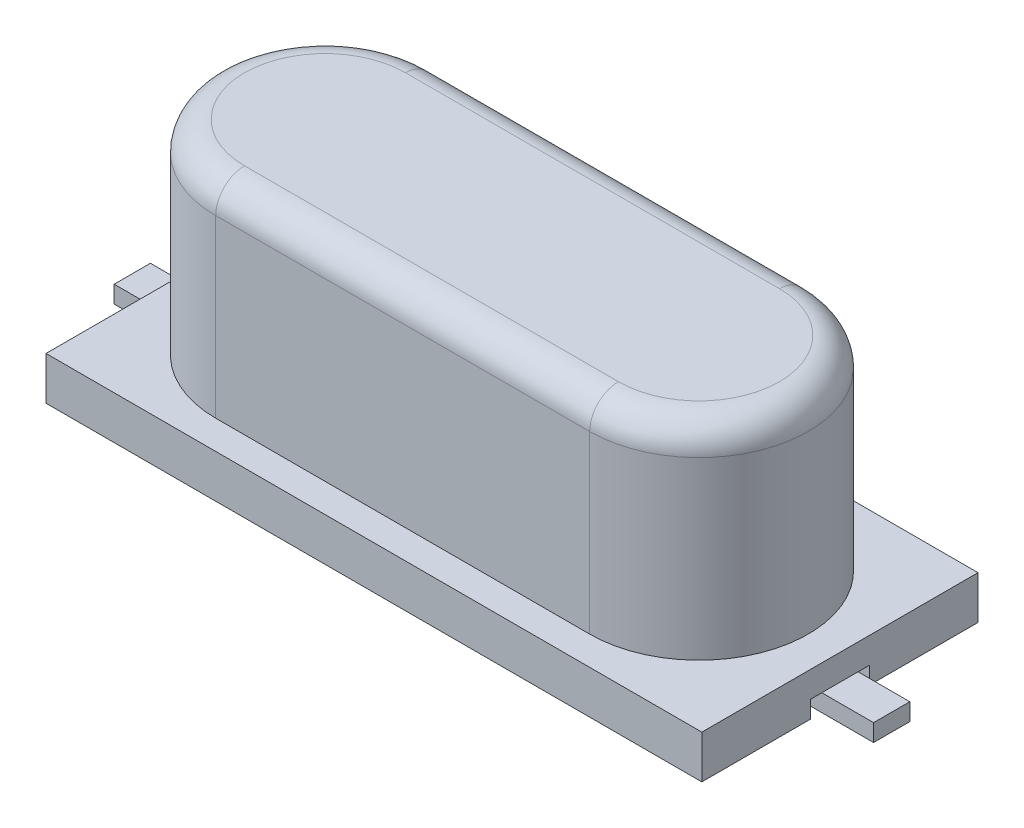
ISO-10303-21;
HEADER;
FILE_DESCRIPTION(('STEP AP214'),'2;1');
FILE_NAME('part.step','',(''),(''),'','','');
FILE_SCHEMA(('AUTOMOTIVE_DESIGN { 1 0 10303 214 1 1 1 1 }'));
ENDSEC;
DATA;
#1=APPLICATION_CONTEXT('core data for automotive mechanical design processes');
#2=APPLICATION_PROTOCOL_DEFINITION('international standard','automotive_design',2000,#1);
#3=PRODUCT_CONTEXT('',#1,'mechanical');
#4=PRODUCT('Part','Part','',(#3));
#5=PRODUCT_RELATED_PRODUCT_CATEGORY('part','',(#4));
#6=PRODUCT_DEFINITION_FORMATION('','',#4);
#7=PRODUCT_DEFINITION_CONTEXT('part definition',#1,'design');
#8=PRODUCT_DEFINITION('design','',#6,#7);
#9=PRODUCT_DEFINITION_SHAPE('','',#8);
#10=(LENGTH_UNIT() NAMED_UNIT(*) SI_UNIT(.MILLI.,.METRE.));
#11=(NAMED_UNIT(*) PLANE_ANGLE_UNIT() SI_UNIT($,.RADIAN.));
#12=(NAMED_UNIT(*) SI_UNIT($,.STERADIAN.) SOLID_ANGLE_UNIT());
#13=UNCERTAINTY_MEASURE_WITH_UNIT(LENGTH_MEASURE(1.E-05),#10,'distance_accuracy_value','');
#14=(GEOMETRIC_REPRESENTATION_CONTEXT(3) GLOBAL_UNCERTAINTY_ASSIGNED_CONTEXT((#13)) GLOBAL_UNIT_ASSIGNED_CONTEXT((#10,
#11,#12)) REPRESENTATION_CONTEXT('',''));
#15=CARTESIAN_POINT('',(0.,0.,0.));
#16=DIRECTION('',(0.,0.,1.));
#17=DIRECTION('',(1.,0.,0.));
#18=AXIS2_PLACEMENT_3D('',#15,#16,#17);
#19=CARTESIAN_POINT('',(-5.7,0.75,-2.4));
#20=DIRECTION('',(0.,-1.,0.));
#21=DIRECTION('',(0.,0.,-1.));
#22=AXIS2_PLACEMENT_3D('',#19,#20,#21);
#23=PLANE('',#22);
#24=DIRECTION('',(0.,0.,1.));
#25=VECTOR('',#24,1.);
#26=CARTESIAN_POINT('',(-5.7,0.75,2.4));
#27=LINE('',#26,#25);
#28=CARTESIAN_POINT('',(-5.7,0.75,-2.4));
#29=VERTEX_POINT('',#28);
#30=CARTESIAN_POINT('',(-5.7,0.75,2.4));
#31=VERTEX_POINT('',#30);
#32=EDGE_CURVE('E405',#29,#31,#27,.T.);
#33=ORIENTED_EDGE('',*,*,#32,.T.);
#34=DIRECTION('',(1.,0.,0.));
#35=VECTOR('',#34,1.);
#36=CARTESIAN_POINT('',(-5.7,0.75,2.4));
#37=LINE('',#36,#35);
#38=CARTESIAN_POINT('',(5.7,0.75,2.4));
#39=VERTEX_POINT('',#38);
#40=EDGE_CURVE('E409',#31,#39,#37,.T.);
#41=ORIENTED_EDGE('',*,*,#40,.T.);
#42=DIRECTION('',(0.,0.,-1.));
#43=VECTOR('',#42,1.);
#44=CARTESIAN_POINT('',(5.7,0.75,2.4));
#45=LINE('',#44,#43);
#46=CARTESIAN_POINT('',(5.7,0.75,-2.4));
#47=VERTEX_POINT('',#46);
#48=EDGE_CURVE('E413',#39,#47,#45,.T.);
#49=ORIENTED_EDGE('',*,*,#48,.T.);
#50=DIRECTION('',(-1.,0.,0.));
#51=VECTOR('',#50,1.);
#52=CARTESIAN_POINT('',(-5.7,0.75,-2.4));
#53=LINE('',#52,#51);
#54=EDGE_CURVE('E416',#47,#29,#53,.T.);
#55=ORIENTED_EDGE('',*,*,#54,.T.);
#56=EDGE_LOOP('',(#33,#41,#49,#55));
#57=FACE_BOUND('',#56,.T.);
#58=CARTESIAN_POINT('',(-3.25,0.75,0.));
#59=DIRECTION('',(0.,1.,0.));
#60=DIRECTION('',(0.,0.,1.));
#61=AXIS2_PLACEMENT_3D('',#58,#59,#60);
#62=CIRCLE('',#61,1.9);
#63=CARTESIAN_POINT('',(-3.25,0.75,-1.9));
#64=VERTEX_POINT('',#63);
#65=CARTESIAN_POINT('',(-3.25,0.75,1.9));
#66=VERTEX_POINT('',#65);
#67=EDGE_CURVE('E226',#64,#66,#62,.T.);
#68=ORIENTED_EDGE('',*,*,#67,.F.);
#69=DIRECTION('',(-1.,0.,0.));
#70=VECTOR('',#69,1.);
#71=CARTESIAN_POINT('',(-3.25,0.75,-1.9));
#72=LINE('',#71,#70);
#73=CARTESIAN_POINT('',(3.25,0.75,-1.9));
#74=VERTEX_POINT('',#73);
#75=EDGE_CURVE('E234',#74,#64,#72,.T.);
#76=ORIENTED_EDGE('',*,*,#75,.F.);
#77=CARTESIAN_POINT('',(3.25,0.75,0.));
#78=DIRECTION('',(0.,1.,0.));
#79=DIRECTION('',(0.,0.,1.));
#80=AXIS2_PLACEMENT_3D('',#77,#78,#79);
#81=CIRCLE('',#80,1.9);
#82=CARTESIAN_POINT('',(3.25,0.75,1.9));
#83=VERTEX_POINT('',#82);
#84=EDGE_CURVE('E247',#83,#74,#81,.T.);
#85=ORIENTED_EDGE('',*,*,#84,.F.);
#86=DIRECTION('',(1.,0.,0.));
#87=VECTOR('',#86,1.);
#88=CARTESIAN_POINT('',(-3.25,0.75,1.9));
#89=LINE('',#88,#87);
#90=EDGE_CURVE('E242',#66,#83,#89,.T.);
#91=ORIENTED_EDGE('',*,*,#90,.F.);
#92=EDGE_LOOP('',(#68,#76,#85,#91));
#93=FACE_BOUND('',#92,.T.);
#94=ADVANCED_FACE('F36',(#57,#93),#23,.F.);
#95=CARTESIAN_POINT('',(-5.7,0.3,-2.4));
#96=DIRECTION('',(0.,-1.,0.));
#97=DIRECTION('',(0.,0.,-1.));
#98=AXIS2_PLACEMENT_3D('',#95,#96,#97);
#99=PLANE('',#98);
#100=DIRECTION('',(0.,0.,1.));
#101=VECTOR('',#100,1.);
#102=CARTESIAN_POINT('',(-5.7,0.3,2.4));
#103=LINE('',#102,#101);
#104=CARTESIAN_POINT('',(-5.7,0.3,-0.515));
#105=VERTEX_POINT('',#104);
#106=CARTESIAN_POINT('',(-5.7,0.3,-0.315));
#107=VERTEX_POINT('',#106);
#108=EDGE_CURVE('E420',#105,#107,#103,.T.);
#109=ORIENTED_EDGE('',*,*,#108,.F.);
#110=DIRECTION('',(1.,0.,0.));
#111=VECTOR('',#110,1.);
#112=CARTESIAN_POINT('',(-2.,0.3,-0.515000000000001));
#113=LINE('',#112,#111);
#114=CARTESIAN_POINT('',(-2.,0.3,-0.515000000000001));
#115=VERTEX_POINT('',#114);
#116=EDGE_CURVE('E268',#105,#115,#113,.T.);
#117=ORIENTED_EDGE('',*,*,#116,.T.);
#118=DIRECTION('',(0.,0.,1.));
#119=VECTOR('',#118,1.);
#120=CARTESIAN_POINT('',(-2.,0.3,0.515000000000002));
#121=LINE('',#120,#119);
#122=CARTESIAN_POINT('',(-2.,0.3,0.515000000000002));
#123=VERTEX_POINT('',#122);
#124=EDGE_CURVE('E273',#115,#123,#121,.T.);
#125=ORIENTED_EDGE('',*,*,#124,.T.);
#126=DIRECTION('',(-1.,0.,0.));
#127=VECTOR('',#126,1.);
#128=CARTESIAN_POINT('',(-5.7,0.3,0.515000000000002));
#129=LINE('',#128,#127);
#130=CARTESIAN_POINT('',(-5.7,0.3,0.515000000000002));
#131=VERTEX_POINT('',#130);
#132=EDGE_CURVE('E277',#123,#131,#129,.T.);
#133=ORIENTED_EDGE('',*,*,#132,.T.);
#134=CARTESIAN_POINT('',(-5.7,0.3,0.315000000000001));
#135=VERTEX_POINT('',#134);
#136=EDGE_CURVE('E404',#135,#131,#103,.T.);
#137=ORIENTED_EDGE('',*,*,#136,.F.);
#138=DIRECTION('',(1.,0.,0.));
#139=VECTOR('',#138,1.);
#140=CARTESIAN_POINT('',(-6.6,0.3,0.315));
#141=LINE('',#140,#139);
#142=CARTESIAN_POINT('',(-2.2,0.3,0.315000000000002));
#143=VERTEX_POINT('',#142);
#144=EDGE_CURVE('E443',#135,#143,#141,.T.);
#145=ORIENTED_EDGE('',*,*,#144,.T.);
#146=DIRECTION('',(0.,0.,-1.));
#147=VECTOR('',#146,1.);
#148=CARTESIAN_POINT('',(-2.2,0.3,0.315000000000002));
#149=LINE('',#148,#147);
#150=CARTESIAN_POINT('',(-2.2,0.3,-0.315000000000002));
#151=VERTEX_POINT('',#150);
#152=EDGE_CURVE('E448',#143,#151,#149,.T.);
#153=ORIENTED_EDGE('',*,*,#152,.T.);
#154=DIRECTION('',(-1.,0.,0.));
#155=VECTOR('',#154,1.);
#156=CARTESIAN_POINT('',(-6.6,0.3,-0.315));
#157=LINE('',#156,#155);
#158=EDGE_CURVE('E453',#151,#107,#157,.T.);
#159=ORIENTED_EDGE('',*,*,#158,.T.);
#160=EDGE_LOOP('',(#109,#117,#125,#133,#137,#145,#153,#159));
#161=FACE_BOUND('',#160,.T.);
#162=ADVANCED_FACE('F599',(#161),#99,.T.);
#163=DIRECTION('',(0.,0.,-1.));
#164=VECTOR('',#163,1.);
#165=CARTESIAN_POINT('',(2.,0.3,-0.515000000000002));
#166=LINE('',#165,#164);
#167=CARTESIAN_POINT('',(2.,0.3,0.515000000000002));
#168=VERTEX_POINT('',#167);
#169=CARTESIAN_POINT('',(2.,0.3,-0.515000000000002));
#170=VERTEX_POINT('',#169);
#171=EDGE_CURVE('E285',#168,#170,#166,.T.);
#172=ORIENTED_EDGE('',*,*,#171,.T.);
#173=DIRECTION('',(1.,0.,0.));
#174=VECTOR('',#173,1.);
#175=CARTESIAN_POINT('',(5.7,0.3,-0.515000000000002));
#176=LINE('',#175,#174);
#177=CARTESIAN_POINT('',(5.7,0.3,-0.515000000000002));
#178=VERTEX_POINT('',#177);
#179=EDGE_CURVE('E264',#170,#178,#176,.T.);
#180=ORIENTED_EDGE('',*,*,#179,.T.);
#181=DIRECTION('',(0.,0.,-1.));
#182=VECTOR('',#181,1.);
#183=CARTESIAN_POINT('',(5.7,0.3,2.4));
#184=LINE('',#183,#182);
#185=CARTESIAN_POINT('',(5.7,0.3,-0.315));
#186=VERTEX_POINT('',#185);
#187=EDGE_CURVE('E423',#186,#178,#184,.T.);
#188=ORIENTED_EDGE('',*,*,#187,.F.);
#189=DIRECTION('',(-1.,0.,0.));
#190=VECTOR('',#189,1.);
#191=CARTESIAN_POINT('',(-5.7,0.3,-0.315000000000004));
#192=LINE('',#191,#190);
#193=CARTESIAN_POINT('',(2.2,0.3,-0.315000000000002));
#194=VERTEX_POINT('',#193);
#195=EDGE_CURVE('E484',#186,#194,#192,.T.);
#196=ORIENTED_EDGE('',*,*,#195,.T.);
#197=DIRECTION('',(0.,0.,1.));
#198=VECTOR('',#197,1.);
#199=CARTESIAN_POINT('',(2.2,0.3,0.315000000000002));
#200=LINE('',#199,#198);
#201=CARTESIAN_POINT('',(2.2,0.3,0.315000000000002));
#202=VERTEX_POINT('',#201);
#203=EDGE_CURVE('E373',#194,#202,#200,.T.);
#204=ORIENTED_EDGE('',*,*,#203,.T.);
#205=DIRECTION('',(1.,0.,0.));
#206=VECTOR('',#205,1.);
#207=CARTESIAN_POINT('',(6.6,0.3,0.315));
#208=LINE('',#207,#206);
#209=CARTESIAN_POINT('',(5.7,0.3,0.315));
#210=VERTEX_POINT('',#209);
#211=EDGE_CURVE('E361',#202,#210,#208,.T.);
#212=ORIENTED_EDGE('',*,*,#211,.T.);
#213=CARTESIAN_POINT('',(5.7,0.3,0.515000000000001));
#214=VERTEX_POINT('',#213);
#215=EDGE_CURVE('E410',#214,#210,#184,.T.);
#216=ORIENTED_EDGE('',*,*,#215,.F.);
#217=DIRECTION('',(-1.,0.,0.));
#218=VECTOR('',#217,1.);
#219=CARTESIAN_POINT('',(2.,0.3,0.515000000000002));
#220=LINE('',#219,#218);
#221=EDGE_CURVE('E281',#214,#168,#220,.T.);
#222=ORIENTED_EDGE('',*,*,#221,.T.);
#223=EDGE_LOOP('',(#172,#180,#188,#196,#204,#212,#216,#222));
#224=FACE_BOUND('',#223,.T.);
#225=ADVANCED_FACE('F546',(#224),#99,.T.);
#226=CARTESIAN_POINT('',(-6.6,0.3,-0.315));
#227=DIRECTION('',(0.,-1.,0.));
#228=DIRECTION('',(0.,0.,-1.));
#229=AXIS2_PLACEMENT_3D('',#226,#227,#228);
#230=PLANE('',#229);
#231=EDGE_CURVE('E424',#107,#135,#103,.T.);
#232=ORIENTED_EDGE('',*,*,#231,.F.);
#233=CARTESIAN_POINT('',(-6.6,0.3,-0.315));
#234=VERTEX_POINT('',#233);
#235=EDGE_CURVE('E452',#107,#234,#157,.T.);
#236=ORIENTED_EDGE('',*,*,#235,.T.);
#237=DIRECTION('',(0.,0.,1.));
#238=VECTOR('',#237,1.);
#239=CARTESIAN_POINT('',(-6.6,0.3,0.315));
#240=LINE('',#239,#238);
#241=CARTESIAN_POINT('',(-6.6,0.3,0.315));
#242=VERTEX_POINT('',#241);
#243=EDGE_CURVE('E439',#234,#242,#240,.T.);
#244=ORIENTED_EDGE('',*,*,#243,.T.);
#245=EDGE_CURVE('E445',#242,#135,#141,.T.);
#246=ORIENTED_EDGE('',*,*,#245,.T.);
#247=EDGE_LOOP('',(#232,#236,#244,#246));
#248=FACE_BOUND('',#247,.T.);
#249=ADVANCED_FACE('F616',(#248),#230,.F.);
#250=CARTESIAN_POINT('',(-6.6,0.3,0.315));
#251=DIRECTION('',(1.,0.,0.));
#252=DIRECTION('',(0.,0.,-1.));
#253=AXIS2_PLACEMENT_3D('',#250,#251,#252);
#254=PLANE('',#253);
#255=DIRECTION('',(0.,0.,1.));
#256=VECTOR('',#255,1.);
#257=CARTESIAN_POINT('',(-6.6,0.,0.315));
#258=LINE('',#257,#256);
#259=CARTESIAN_POINT('',(-6.6,0.,-0.315));
#260=VERTEX_POINT('',#259);
#261=CARTESIAN_POINT('',(-6.6,0.,0.315));
#262=VERTEX_POINT('',#261);
#263=EDGE_CURVE('E438',#260,#262,#258,.T.);
#264=ORIENTED_EDGE('',*,*,#263,.T.);
#265=DIRECTION('',(0.,-1.,0.));
#266=VECTOR('',#265,1.);
#267=CARTESIAN_POINT('',(-6.6,0.3,0.315));
#268=LINE('',#267,#266);
#269=EDGE_CURVE('E480',#242,#262,#268,.T.);
#270=ORIENTED_EDGE('',*,*,#269,.F.);
#271=ORIENTED_EDGE('',*,*,#243,.F.);
#272=DIRECTION('',(0.,-1.,0.));
#273=VECTOR('',#272,1.);
#274=CARTESIAN_POINT('',(-6.6,0.3,-0.315));
#275=LINE('',#274,#273);
#276=EDGE_CURVE('E457',#234,#260,#275,.T.);
#277=ORIENTED_EDGE('',*,*,#276,.T.);
#278=EDGE_LOOP('',(#264,#270,#271,#277));
#279=FACE_BOUND('',#278,.T.);
#280=ADVANCED_FACE('F625',(#279),#254,.F.);
#281=CARTESIAN_POINT('',(-6.6,0.3,0.315));
#282=DIRECTION('',(0.,0.,-1.));
#283=DIRECTION('',(-1.,0.,0.));
#284=AXIS2_PLACEMENT_3D('',#281,#282,#283);
#285=PLANE('',#284);
#286=DIRECTION('',(1.,0.,0.));
#287=VECTOR('',#286,1.);
#288=CARTESIAN_POINT('',(-6.6,0.,0.315));
#289=LINE('',#288,#287);
#290=CARTESIAN_POINT('',(-2.2,0.,0.315000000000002));
#291=VERTEX_POINT('',#290);
#292=EDGE_CURVE('E461',#262,#291,#289,.T.);
#293=ORIENTED_EDGE('',*,*,#292,.T.);
#294=DIRECTION('',(0.,-1.,0.));
#295=VECTOR('',#294,1.);
#296=CARTESIAN_POINT('',(-2.2,0.3,0.315000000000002));
#297=LINE('',#296,#295);
#298=EDGE_CURVE('E476',#143,#291,#297,.T.);
#299=ORIENTED_EDGE('',*,*,#298,.F.);
#300=ORIENTED_EDGE('',*,*,#144,.F.);
#301=ORIENTED_EDGE('',*,*,#245,.F.);
#302=ORIENTED_EDGE('',*,*,#269,.T.);
#303=EDGE_LOOP('',(#293,#299,#300,#301,#302));
#304=FACE_BOUND('',#303,.T.);
#305=ADVANCED_FACE('F627',(#304),#285,.F.);
#306=CARTESIAN_POINT('',(-2.2,0.3,0.315000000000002));
#307=DIRECTION('',(-1.,0.,0.));
#308=DIRECTION('',(0.,0.,1.));
#309=AXIS2_PLACEMENT_3D('',#306,#307,#308);
#310=PLANE('',#309);
#311=DIRECTION('',(0.,0.,-1.));
#312=VECTOR('',#311,1.);
#313=CARTESIAN_POINT('',(-2.2,0.,0.315000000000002));
#314=LINE('',#313,#312);
#315=CARTESIAN_POINT('',(-2.2,0.,-0.315000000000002));
#316=VERTEX_POINT('',#315);
#317=EDGE_CURVE('E464',#291,#316,#314,.T.);
#318=ORIENTED_EDGE('',*,*,#317,.T.);
#319=DIRECTION('',(0.,-1.,0.));
#320=VECTOR('',#319,1.);
#321=CARTESIAN_POINT('',(-2.2,0.3,-0.315000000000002));
#322=LINE('',#321,#320);
#323=EDGE_CURVE('E472',#151,#316,#322,.T.);
#324=ORIENTED_EDGE('',*,*,#323,.F.);
#325=ORIENTED_EDGE('',*,*,#152,.F.);
#326=ORIENTED_EDGE('',*,*,#298,.T.);
#327=EDGE_LOOP('',(#318,#324,#325,#326));
#328=FACE_BOUND('',#327,.T.);
#329=ADVANCED_FACE('F631',(#328),#310,.F.);
#330=CARTESIAN_POINT('',(-6.6,0.3,-0.315));
#331=DIRECTION('',(0.,0.,1.));
#332=DIRECTION('',(1.,0.,0.));
#333=AXIS2_PLACEMENT_3D('',#330,#331,#332);
#334=PLANE('',#333);
#335=DIRECTION('',(-1.,0.,0.));
#336=VECTOR('',#335,1.);
#337=CARTESIAN_POINT('',(-6.6,0.,-0.315));
#338=LINE('',#337,#336);
#339=EDGE_CURVE('E444',#316,#260,#338,.T.);
#340=ORIENTED_EDGE('',*,*,#339,.T.);
#341=ORIENTED_EDGE('',*,*,#276,.F.);
#342=ORIENTED_EDGE('',*,*,#235,.F.);
#343=ORIENTED_EDGE('',*,*,#158,.F.);
#344=ORIENTED_EDGE('',*,*,#323,.T.);
#345=EDGE_LOOP('',(#340,#341,#342,#343,#344));
#346=FACE_BOUND('',#345,.T.);
#347=ADVANCED_FACE('F619',(#346),#334,.F.);
#348=CARTESIAN_POINT('',(-6.6,0.,-0.315));
#349=DIRECTION('',(0.,-1.,0.));
#350=DIRECTION('',(0.,0.,-1.));
#351=AXIS2_PLACEMENT_3D('',#348,#349,#350);
#352=PLANE('',#351);
#353=ORIENTED_EDGE('',*,*,#263,.F.);
#354=ORIENTED_EDGE('',*,*,#339,.F.);
#355=ORIENTED_EDGE('',*,*,#317,.F.);
#356=ORIENTED_EDGE('',*,*,#292,.F.);
#357=EDGE_LOOP('',(#353,#354,#355,#356));
#358=FACE_BOUND('',#357,.T.);
#359=ADVANCED_FACE('F633',(#358),#352,.T.);
#360=CARTESIAN_POINT('',(-5.7,0.75,2.4));
#361=DIRECTION('',(1.,0.,0.));
#362=DIRECTION('',(0.,0.,-1.));
#363=AXIS2_PLACEMENT_3D('',#360,#361,#362);
#364=PLANE('',#363);
#365=DIRECTION('',(0.,-1.,0.));
#366=VECTOR('',#365,1.);
#367=CARTESIAN_POINT('',(-5.7,0.75,-2.4));
#368=LINE('',#367,#366);
#369=CARTESIAN_POINT('',(-5.7,0.,-2.4));
#370=VERTEX_POINT('',#369);
#371=EDGE_CURVE('E419',#29,#370,#368,.T.);
#372=ORIENTED_EDGE('',*,*,#371,.T.);
#373=DIRECTION('',(0.,0.,1.));
#374=VECTOR('',#373,1.);
#375=CARTESIAN_POINT('',(-5.7,0.,-0.515));
#376=LINE('',#375,#374);
#377=CARTESIAN_POINT('',(-5.7,0.,-0.515));
#378=VERTEX_POINT('',#377);
#379=EDGE_CURVE('E301',#370,#378,#376,.T.);
#380=ORIENTED_EDGE('',*,*,#379,.T.);
#381=DIRECTION('',(0.,-1.,0.));
#382=VECTOR('',#381,1.);
#383=CARTESIAN_POINT('',(-5.7,0.3,-0.515));
#384=LINE('',#383,#382);
#385=EDGE_CURVE('E352',#105,#378,#384,.T.);
#386=ORIENTED_EDGE('',*,*,#385,.F.);
#387=ORIENTED_EDGE('',*,*,#108,.T.);
#388=ORIENTED_EDGE('',*,*,#231,.T.);
#389=ORIENTED_EDGE('',*,*,#136,.T.);
#390=DIRECTION('',(0.,-1.,0.));
#391=VECTOR('',#390,1.);
#392=CARTESIAN_POINT('',(-5.7,0.3,0.515000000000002));
#393=LINE('',#392,#391);
#394=CARTESIAN_POINT('',(-5.7,0.,0.515000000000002));
#395=VERTEX_POINT('',#394);
#396=EDGE_CURVE('E340',#131,#395,#393,.T.);
#397=ORIENTED_EDGE('',*,*,#396,.T.);
#398=DIRECTION('',(0.,0.,1.));
#399=VECTOR('',#398,1.);
#400=CARTESIAN_POINT('',(-5.7,0.,0.515000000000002));
#401=LINE('',#400,#399);
#402=CARTESIAN_POINT('',(-5.7,0.,2.4));
#403=VERTEX_POINT('',#402);
#404=EDGE_CURVE('E313',#395,#403,#401,.T.);
#405=ORIENTED_EDGE('',*,*,#404,.T.);
#406=DIRECTION('',(0.,-1.,0.));
#407=VECTOR('',#406,1.);
#408=CARTESIAN_POINT('',(-5.7,0.75,2.4));
#409=LINE('',#408,#407);
#410=EDGE_CURVE('E435',#31,#403,#409,.T.);
#411=ORIENTED_EDGE('',*,*,#410,.F.);
#412=ORIENTED_EDGE('',*,*,#32,.F.);
#413=EDGE_LOOP('',(#372,#380,#386,#387,#388,#389,#397,#405,#411,#412));
#414=FACE_BOUND('',#413,.T.);
#415=ADVANCED_FACE('F594',(#414),#364,.F.);
#416=CARTESIAN_POINT('',(-5.7,0.75,2.4));
#417=DIRECTION('',(0.,0.,-1.));
#418=DIRECTION('',(-1.,0.,0.));
#419=AXIS2_PLACEMENT_3D('',#416,#417,#418);
#420=PLANE('',#419);
#421=ORIENTED_EDGE('',*,*,#410,.T.);
#422=DIRECTION('',(1.,0.,0.));
#423=VECTOR('',#422,1.);
#424=CARTESIAN_POINT('',(-5.7,0.,2.4));
#425=LINE('',#424,#423);
#426=CARTESIAN_POINT('',(5.7,0.,2.4));
#427=VERTEX_POINT('',#426);
#428=EDGE_CURVE('E317',#403,#427,#425,.T.);
#429=ORIENTED_EDGE('',*,*,#428,.T.);
#430=DIRECTION('',(0.,-1.,0.));
#431=VECTOR('',#430,1.);
#432=CARTESIAN_POINT('',(5.7,0.75,2.4));
#433=LINE('',#432,#431);
#434=EDGE_CURVE('E432',#39,#427,#433,.T.);
#435=ORIENTED_EDGE('',*,*,#434,.F.);
#436=ORIENTED_EDGE('',*,*,#40,.F.);
#437=EDGE_LOOP('',(#421,#429,#435,#436));
#438=FACE_BOUND('',#437,.T.);
#439=ADVANCED_FACE('F569',(#438),#420,.F.);
#440=CARTESIAN_POINT('',(5.7,0.75,2.4));
#441=DIRECTION('',(-1.,0.,0.));
#442=DIRECTION('',(0.,0.,1.));
#443=AXIS2_PLACEMENT_3D('',#440,#441,#442);
#444=PLANE('',#443);
#445=ORIENTED_EDGE('',*,*,#434,.T.);
#446=DIRECTION('',(0.,0.,-1.));
#447=VECTOR('',#446,1.);
#448=CARTESIAN_POINT('',(5.7,0.,2.4));
#449=LINE('',#448,#447);
#450=CARTESIAN_POINT('',(5.7,0.,0.515000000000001));
#451=VERTEX_POINT('',#450);
#452=EDGE_CURVE('E321',#427,#451,#449,.T.);
#453=ORIENTED_EDGE('',*,*,#452,.T.);
#454=DIRECTION('',(0.,-1.,0.));
#455=VECTOR('',#454,1.);
#456=CARTESIAN_POINT('',(5.7,0.3,0.515000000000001));
#457=LINE('',#456,#455);
#458=EDGE_CURVE('E336',#214,#451,#457,.T.);
#459=ORIENTED_EDGE('',*,*,#458,.F.);
#460=ORIENTED_EDGE('',*,*,#215,.T.);
#461=EDGE_CURVE('E426',#210,#186,#184,.T.);
#462=ORIENTED_EDGE('',*,*,#461,.T.);
#463=ORIENTED_EDGE('',*,*,#187,.T.);
#464=DIRECTION('',(0.,-1.,0.));
#465=VECTOR('',#464,1.);
#466=CARTESIAN_POINT('',(5.7,0.3,-0.515000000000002));
#467=LINE('',#466,#465);
#468=CARTESIAN_POINT('',(5.7,0.,-0.515000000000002));
#469=VERTEX_POINT('',#468);
#470=EDGE_CURVE('E356',#178,#469,#467,.T.);
#471=ORIENTED_EDGE('',*,*,#470,.T.);
#472=DIRECTION('',(0.,0.,-1.));
#473=VECTOR('',#472,1.);
#474=CARTESIAN_POINT('',(5.7,0.,-0.515000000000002));
#475=LINE('',#474,#473);
#476=CARTESIAN_POINT('',(5.7,0.,-2.4));
#477=VERTEX_POINT('',#476);
#478=EDGE_CURVE('E293',#469,#477,#475,.T.);
#479=ORIENTED_EDGE('',*,*,#478,.T.);
#480=DIRECTION('',(0.,-1.,0.));
#481=VECTOR('',#480,1.);
#482=CARTESIAN_POINT('',(5.7,0.75,-2.4));
#483=LINE('',#482,#481);
#484=EDGE_CURVE('E429',#47,#477,#483,.T.);
#485=ORIENTED_EDGE('',*,*,#484,.F.);
#486=ORIENTED_EDGE('',*,*,#48,.F.);
#487=EDGE_LOOP('',(#445,#453,#459,#460,#462,#463,#471,#479,#485,#486));
#488=FACE_BOUND('',#487,.T.);
#489=ADVANCED_FACE('F543',(#488),#444,.F.);
#490=CARTESIAN_POINT('',(-5.7,0.75,-2.4));
#491=DIRECTION('',(0.,0.,1.));
#492=DIRECTION('',(1.,0.,0.));
#493=AXIS2_PLACEMENT_3D('',#490,#491,#492);
#494=PLANE('',#493);
#495=ORIENTED_EDGE('',*,*,#484,.T.);
#496=DIRECTION('',(-1.,0.,0.));
#497=VECTOR('',#496,1.);
#498=CARTESIAN_POINT('',(-5.7,0.,-2.4));
#499=LINE('',#498,#497);
#500=EDGE_CURVE('E297',#477,#370,#499,.T.);
#501=ORIENTED_EDGE('',*,*,#500,.T.);
#502=ORIENTED_EDGE('',*,*,#371,.F.);
#503=ORIENTED_EDGE('',*,*,#54,.F.);
#504=EDGE_LOOP('',(#495,#501,#502,#503));
#505=FACE_BOUND('',#504,.T.);
#506=ADVANCED_FACE('F563',(#505),#494,.F.);
#507=CARTESIAN_POINT('',(2.2,0.3,0.315000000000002));
#508=DIRECTION('',(0.,-1.,0.));
#509=DIRECTION('',(0.,0.,-1.));
#510=AXIS2_PLACEMENT_3D('',#507,#508,#509);
#511=PLANE('',#510);
#512=DIRECTION('',(-1.,0.,0.));
#513=VECTOR('',#512,1.);
#514=CARTESIAN_POINT('',(6.6,0.3,-0.315));
#515=LINE('',#514,#513);
#516=CARTESIAN_POINT('',(6.6,0.3,-0.315));
#517=VERTEX_POINT('',#516);
#518=EDGE_CURVE('E369',#517,#186,#515,.T.);
#519=ORIENTED_EDGE('',*,*,#518,.T.);
#520=ORIENTED_EDGE('',*,*,#461,.F.);
#521=CARTESIAN_POINT('',(6.6,0.3,0.315));
#522=VERTEX_POINT('',#521);
#523=EDGE_CURVE('E366',#210,#522,#208,.T.);
#524=ORIENTED_EDGE('',*,*,#523,.T.);
#525=DIRECTION('',(0.,0.,-1.));
#526=VECTOR('',#525,1.);
#527=CARTESIAN_POINT('',(6.6,0.3,0.315));
#528=LINE('',#527,#526);
#529=EDGE_CURVE('E365',#522,#517,#528,.T.);
#530=ORIENTED_EDGE('',*,*,#529,.T.);
#531=EDGE_LOOP('',(#519,#520,#524,#530));
#532=FACE_BOUND('',#531,.T.);
#533=ADVANCED_FACE('F578',(#532),#511,.F.);
#534=CARTESIAN_POINT('',(6.6,0.3,0.315));
#535=DIRECTION('',(0.,0.,-1.));
#536=DIRECTION('',(-1.,0.,0.));
#537=AXIS2_PLACEMENT_3D('',#534,#535,#536);
#538=PLANE('',#537);
#539=DIRECTION('',(1.,0.,0.));
#540=VECTOR('',#539,1.);
#541=CARTESIAN_POINT('',(6.6,0.,0.315));
#542=LINE('',#541,#540);
#543=CARTESIAN_POINT('',(2.2,0.,0.315000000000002));
#544=VERTEX_POINT('',#543);
#545=CARTESIAN_POINT('',(6.6,0.,0.315));
#546=VERTEX_POINT('',#545);
#547=EDGE_CURVE('E360',#544,#546,#542,.T.);
#548=ORIENTED_EDGE('',*,*,#547,.T.);
#549=DIRECTION('',(0.,-1.,0.));
#550=VECTOR('',#549,1.);
#551=CARTESIAN_POINT('',(6.6,0.3,0.315));
#552=LINE('',#551,#550);
#553=EDGE_CURVE('E401',#522,#546,#552,.T.);
#554=ORIENTED_EDGE('',*,*,#553,.F.);
#555=ORIENTED_EDGE('',*,*,#523,.F.);
#556=ORIENTED_EDGE('',*,*,#211,.F.);
#557=DIRECTION('',(0.,-1.,0.));
#558=VECTOR('',#557,1.);
#559=CARTESIAN_POINT('',(2.2,0.3,0.315000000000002));
#560=LINE('',#559,#558);
#561=EDGE_CURVE('E377',#202,#544,#560,.T.);
#562=ORIENTED_EDGE('',*,*,#561,.T.);
#563=EDGE_LOOP('',(#548,#554,#555,#556,#562));
#564=FACE_BOUND('',#563,.T.);
#565=ADVANCED_FACE('F583',(#564),#538,.F.);
#566=CARTESIAN_POINT('',(6.6,0.3,0.315));
#567=DIRECTION('',(-1.,0.,0.));
#568=DIRECTION('',(0.,0.,1.));
#569=AXIS2_PLACEMENT_3D('',#566,#567,#568);
#570=PLANE('',#569);
#571=DIRECTION('',(0.,0.,-1.));
#572=VECTOR('',#571,1.);
#573=CARTESIAN_POINT('',(6.6,0.,0.315));
#574=LINE('',#573,#572);
#575=CARTESIAN_POINT('',(6.6,0.,-0.315));
#576=VERTEX_POINT('',#575);
#577=EDGE_CURVE('E381',#546,#576,#574,.T.);
#578=ORIENTED_EDGE('',*,*,#577,.T.);
#579=DIRECTION('',(0.,-1.,0.));
#580=VECTOR('',#579,1.);
#581=CARTESIAN_POINT('',(6.6,0.3,-0.315));
#582=LINE('',#581,#580);
#583=EDGE_CURVE('E397',#517,#576,#582,.T.);
#584=ORIENTED_EDGE('',*,*,#583,.F.);
#585=ORIENTED_EDGE('',*,*,#529,.F.);
#586=ORIENTED_EDGE('',*,*,#553,.T.);
#587=EDGE_LOOP('',(#578,#584,#585,#586));
#588=FACE_BOUND('',#587,.T.);
#589=ADVANCED_FACE('F814',(#588),#570,.F.);
#590=CARTESIAN_POINT('',(6.6,0.3,-0.315));
#591=DIRECTION('',(0.,0.,1.));
#592=DIRECTION('',(1.,0.,0.));
#593=AXIS2_PLACEMENT_3D('',#590,#591,#592);
#594=PLANE('',#593);
#595=DIRECTION('',(-1.,0.,0.));
#596=VECTOR('',#595,1.);
#597=CARTESIAN_POINT('',(6.6,0.,-0.315));
#598=LINE('',#597,#596);
#599=CARTESIAN_POINT('',(2.2,0.,-0.315000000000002));
#600=VERTEX_POINT('',#599);
#601=EDGE_CURVE('E384',#576,#600,#598,.T.);
#602=ORIENTED_EDGE('',*,*,#601,.T.);
#603=DIRECTION('',(0.,-1.,0.));
#604=VECTOR('',#603,1.);
#605=CARTESIAN_POINT('',(2.2,0.3,-0.315000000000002));
#606=LINE('',#605,#604);
#607=EDGE_CURVE('E393',#194,#600,#606,.T.);
#608=ORIENTED_EDGE('',*,*,#607,.F.);
#609=ORIENTED_EDGE('',*,*,#195,.F.);
#610=ORIENTED_EDGE('',*,*,#518,.F.);
#611=ORIENTED_EDGE('',*,*,#583,.T.);
#612=EDGE_LOOP('',(#602,#608,#609,#610,#611));
#613=FACE_BOUND('',#612,.T.);
#614=ADVANCED_FACE('F807',(#613),#594,.F.);
#615=CARTESIAN_POINT('',(2.2,0.3,0.315000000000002));
#616=DIRECTION('',(1.,0.,0.));
#617=DIRECTION('',(0.,0.,-1.));
#618=AXIS2_PLACEMENT_3D('',#615,#616,#617);
#619=PLANE('',#618);
#620=DIRECTION('',(0.,0.,1.));
#621=VECTOR('',#620,1.);
#622=CARTESIAN_POINT('',(2.2,0.,0.315000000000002));
#623=LINE('',#622,#621);
#624=EDGE_CURVE('E387',#600,#544,#623,.T.);
#625=ORIENTED_EDGE('',*,*,#624,.T.);
#626=ORIENTED_EDGE('',*,*,#561,.F.);
#627=ORIENTED_EDGE('',*,*,#203,.F.);
#628=ORIENTED_EDGE('',*,*,#607,.T.);
#629=EDGE_LOOP('',(#625,#626,#627,#628));
#630=FACE_BOUND('',#629,.T.);
#631=ADVANCED_FACE('F800',(#630),#619,.F.);
#632=CARTESIAN_POINT('',(2.2,0.,0.315000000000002));
#633=DIRECTION('',(0.,-1.,0.));
#634=DIRECTION('',(0.,0.,-1.));
#635=AXIS2_PLACEMENT_3D('',#632,#633,#634);
#636=PLANE('',#635);
#637=ORIENTED_EDGE('',*,*,#547,.F.);
#638=ORIENTED_EDGE('',*,*,#624,.F.);
#639=ORIENTED_EDGE('',*,*,#601,.F.);
#640=ORIENTED_EDGE('',*,*,#577,.F.);
#641=EDGE_LOOP('',(#637,#638,#639,#640));
#642=FACE_BOUND('',#641,.T.);
#643=ADVANCED_FACE('F794',(#642),#636,.T.);
#644=CARTESIAN_POINT('',(5.7,0.3,-0.515000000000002));
#645=DIRECTION('',(0.,0.,-1.));
#646=DIRECTION('',(-1.,0.,0.));
#647=AXIS2_PLACEMENT_3D('',#644,#645,#646);
#648=PLANE('',#647);
#649=DIRECTION('',(1.,0.,0.));
#650=VECTOR('',#649,1.);
#651=CARTESIAN_POINT('',(5.7,0.,-0.515000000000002));
#652=LINE('',#651,#650);
#653=CARTESIAN_POINT('',(2.,0.,-0.515000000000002));
#654=VERTEX_POINT('',#653);
#655=EDGE_CURVE('E263',#654,#469,#652,.T.);
#656=ORIENTED_EDGE('',*,*,#655,.T.);
#657=ORIENTED_EDGE('',*,*,#470,.F.);
#658=ORIENTED_EDGE('',*,*,#179,.F.);
#659=DIRECTION('',(0.,-1.,0.));
#660=VECTOR('',#659,1.);
#661=CARTESIAN_POINT('',(2.,0.3,-0.515000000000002));
#662=LINE('',#661,#660);
#663=EDGE_CURVE('E289',#170,#654,#662,.T.);
#664=ORIENTED_EDGE('',*,*,#663,.T.);
#665=EDGE_LOOP('',(#656,#657,#658,#664));
#666=FACE_BOUND('',#665,.T.);
#667=ADVANCED_FACE('F550',(#666),#648,.F.);
#668=CARTESIAN_POINT('',(-2.,0.3,-0.515000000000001));
#669=DIRECTION('',(0.,0.,-1.));
#670=DIRECTION('',(-1.,0.,0.));
#671=AXIS2_PLACEMENT_3D('',#668,#669,#670);
#672=PLANE('',#671);
#673=DIRECTION('',(1.,0.,0.));
#674=VECTOR('',#673,1.);
#675=CARTESIAN_POINT('',(-2.,0.,-0.515000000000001));
#676=LINE('',#675,#674);
#677=CARTESIAN_POINT('',(-2.,0.,-0.515000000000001));
#678=VERTEX_POINT('',#677);
#679=EDGE_CURVE('E304',#378,#678,#676,.T.);
#680=ORIENTED_EDGE('',*,*,#679,.T.);
#681=DIRECTION('',(0.,-1.,0.));
#682=VECTOR('',#681,1.);
#683=CARTESIAN_POINT('',(-2.,0.3,-0.515000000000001));
#684=LINE('',#683,#682);
#685=EDGE_CURVE('E348',#115,#678,#684,.T.);
#686=ORIENTED_EDGE('',*,*,#685,.F.);
#687=ORIENTED_EDGE('',*,*,#116,.F.);
#688=ORIENTED_EDGE('',*,*,#385,.T.);
#689=EDGE_LOOP('',(#680,#686,#687,#688));
#690=FACE_BOUND('',#689,.T.);
#691=ADVANCED_FACE('F609',(#690),#672,.F.);
#692=CARTESIAN_POINT('',(-2.,0.3,0.515000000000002));
#693=DIRECTION('',(1.,0.,0.));
#694=DIRECTION('',(0.,0.,-1.));
#695=AXIS2_PLACEMENT_3D('',#692,#693,#694);
#696=PLANE('',#695);
#697=DIRECTION('',(0.,0.,1.));
#698=VECTOR('',#697,1.);
#699=CARTESIAN_POINT('',(-2.,0.,0.515000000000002));
#700=LINE('',#699,#698);
#701=CARTESIAN_POINT('',(-2.,0.,0.515000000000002));
#702=VERTEX_POINT('',#701);
#703=EDGE_CURVE('E307',#678,#702,#700,.T.);
#704=ORIENTED_EDGE('',*,*,#703,.T.);
#705=DIRECTION('',(0.,-1.,0.));
#706=VECTOR('',#705,1.);
#707=CARTESIAN_POINT('',(-2.,0.3,0.515000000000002));
#708=LINE('',#707,#706);
#709=EDGE_CURVE('E344',#123,#702,#708,.T.);
#710=ORIENTED_EDGE('',*,*,#709,.F.);
#711=ORIENTED_EDGE('',*,*,#124,.F.);
#712=ORIENTED_EDGE('',*,*,#685,.T.);
#713=EDGE_LOOP('',(#704,#710,#711,#712));
#714=FACE_BOUND('',#713,.T.);
#715=ADVANCED_FACE('F612',(#714),#696,.F.);
#716=CARTESIAN_POINT('',(-5.7,0.3,0.515000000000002));
#717=DIRECTION('',(0.,0.,1.));
#718=DIRECTION('',(1.,0.,0.));
#719=AXIS2_PLACEMENT_3D('',#716,#717,#718);
#720=PLANE('',#719);
#721=DIRECTION('',(-1.,0.,0.));
#722=VECTOR('',#721,1.);
#723=CARTESIAN_POINT('',(-5.7,0.,0.515000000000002));
#724=LINE('',#723,#722);
#725=EDGE_CURVE('E310',#702,#395,#724,.T.);
#726=ORIENTED_EDGE('',*,*,#725,.T.);
#727=ORIENTED_EDGE('',*,*,#396,.F.);
#728=ORIENTED_EDGE('',*,*,#132,.F.);
#729=ORIENTED_EDGE('',*,*,#709,.T.);
#730=EDGE_LOOP('',(#726,#727,#728,#729));
#731=FACE_BOUND('',#730,.T.);
#732=ADVANCED_FACE('F604',(#731),#720,.F.);
#733=CARTESIAN_POINT('',(2.,0.3,0.515000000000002));
#734=DIRECTION('',(0.,0.,1.));
#735=DIRECTION('',(1.,0.,0.));
#736=AXIS2_PLACEMENT_3D('',#733,#734,#735);
#737=PLANE('',#736);
#738=DIRECTION('',(-1.,0.,0.));
#739=VECTOR('',#738,1.);
#740=CARTESIAN_POINT('',(2.,0.,0.515000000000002));
#741=LINE('',#740,#739);
#742=CARTESIAN_POINT('',(2.,0.,0.515000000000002));
#743=VERTEX_POINT('',#742);
#744=EDGE_CURVE('E324',#451,#743,#741,.T.);
#745=ORIENTED_EDGE('',*,*,#744,.T.);
#746=DIRECTION('',(0.,-1.,0.));
#747=VECTOR('',#746,1.);
#748=CARTESIAN_POINT('',(2.,0.3,0.515000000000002));
#749=LINE('',#748,#747);
#750=EDGE_CURVE('E332',#168,#743,#749,.T.);
#751=ORIENTED_EDGE('',*,*,#750,.F.);
#752=ORIENTED_EDGE('',*,*,#221,.F.);
#753=ORIENTED_EDGE('',*,*,#458,.T.);
#754=EDGE_LOOP('',(#745,#751,#752,#753));
#755=FACE_BOUND('',#754,.T.);
#756=ADVANCED_FACE('F574',(#755),#737,.F.);
#757=CARTESIAN_POINT('',(2.,0.3,-0.515000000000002));
#758=DIRECTION('',(-1.,0.,0.));
#759=DIRECTION('',(0.,0.,1.));
#760=AXIS2_PLACEMENT_3D('',#757,#758,#759);
#761=PLANE('',#760);
#762=DIRECTION('',(0.,0.,-1.));
#763=VECTOR('',#762,1.);
#764=CARTESIAN_POINT('',(2.,0.,-0.515000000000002));
#765=LINE('',#764,#763);
#766=EDGE_CURVE('E269',#743,#654,#765,.T.);
#767=ORIENTED_EDGE('',*,*,#766,.T.);
#768=ORIENTED_EDGE('',*,*,#663,.F.);
#769=ORIENTED_EDGE('',*,*,#171,.F.);
#770=ORIENTED_EDGE('',*,*,#750,.T.);
#771=EDGE_LOOP('',(#767,#768,#769,#770));
#772=FACE_BOUND('',#771,.T.);
#773=ADVANCED_FACE('F764',(#772),#761,.F.);
#774=CARTESIAN_POINT('',(5.7,0.,-0.515000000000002));
#775=DIRECTION('',(0.,-1.,0.));
#776=DIRECTION('',(0.,0.,-1.));
#777=AXIS2_PLACEMENT_3D('',#774,#775,#776);
#778=PLANE('',#777);
#779=ORIENTED_EDGE('',*,*,#655,.F.);
#780=ORIENTED_EDGE('',*,*,#766,.F.);
#781=ORIENTED_EDGE('',*,*,#744,.F.);
#782=ORIENTED_EDGE('',*,*,#452,.F.);
#783=ORIENTED_EDGE('',*,*,#428,.F.);
#784=ORIENTED_EDGE('',*,*,#404,.F.);
#785=ORIENTED_EDGE('',*,*,#725,.F.);
#786=ORIENTED_EDGE('',*,*,#703,.F.);
#787=ORIENTED_EDGE('',*,*,#679,.F.);
#788=ORIENTED_EDGE('',*,*,#379,.F.);
#789=ORIENTED_EDGE('',*,*,#500,.F.);
#790=ORIENTED_EDGE('',*,*,#478,.F.);
#791=EDGE_LOOP('',(#779,#780,#781,#782,#783,#784,#785,#786,#787,#788,#789,#790));
#792=FACE_BOUND('',#791,.T.);
#793=ADVANCED_FACE('F554',(#792),#778,.T.);
#794=CARTESIAN_POINT('',(-3.25,4.3,0.));
#795=DIRECTION('',(0.,-1.,0.));
#796=DIRECTION('',(0.,0.,-1.));
#797=AXIS2_PLACEMENT_3D('',#794,#795,#796);
#798=CYLINDRICAL_SURFACE('',#797,1.9);
#799=DIRECTION('',(0.,-1.,0.));
#800=VECTOR('',#799,1.);
#801=CARTESIAN_POINT('',(-3.25,4.3,1.9));
#802=LINE('',#801,#800);
#803=CARTESIAN_POINT('',(-3.25,3.8,1.9));
#804=VERTEX_POINT('',#803);
#805=EDGE_CURVE('E260',#804,#66,#802,.T.);
#806=ORIENTED_EDGE('',*,*,#805,.F.);
#807=CARTESIAN_POINT('',(-3.25,3.8,0.));
#808=DIRECTION('',(0.,1.,0.));
#809=DIRECTION('',(0.,0.,1.));
#810=AXIS2_PLACEMENT_3D('',#807,#808,#809);
#811=CIRCLE('',#810,1.9);
#812=CARTESIAN_POINT('',(-3.25,3.8,-1.9));
#813=VERTEX_POINT('',#812);
#814=EDGE_CURVE('E11',#804,#813,#811,.F.);
#815=ORIENTED_EDGE('',*,*,#814,.T.);
#816=DIRECTION('',(0.,-1.,0.));
#817=VECTOR('',#816,1.);
#818=CARTESIAN_POINT('',(-3.25,4.3,-1.9));
#819=LINE('',#818,#817);
#820=EDGE_CURVE('E223',#813,#64,#819,.T.);
#821=ORIENTED_EDGE('',*,*,#820,.T.);
#822=ORIENTED_EDGE('',*,*,#67,.T.);
#823=EDGE_LOOP('',(#806,#815,#821,#822));
#824=FACE_BOUND('',#823,.T.);
#825=ADVANCED_FACE('F225',(#824),#798,.T.);
#826=CARTESIAN_POINT('',(-3.25,4.3,1.9));
#827=DIRECTION('',(0.,0.,-1.));
#828=DIRECTION('',(-1.,0.,0.));
#829=AXIS2_PLACEMENT_3D('',#826,#827,#828);
#830=PLANE('',#829);
#831=DIRECTION('',(0.,-1.,0.));
#832=VECTOR('',#831,1.);
#833=CARTESIAN_POINT('',(3.25,4.3,1.9));
#834=LINE('',#833,#832);
#835=CARTESIAN_POINT('',(3.25,3.8,1.9));
#836=VERTEX_POINT('',#835);
#837=EDGE_CURVE('E257',#836,#83,#834,.T.);
#838=ORIENTED_EDGE('',*,*,#837,.F.);
#839=DIRECTION('',(1.,0.,0.));
#840=VECTOR('',#839,1.);
#841=CARTESIAN_POINT('',(-3.25,3.8,1.9));
#842=LINE('',#841,#840);
#843=EDGE_CURVE('E46',#836,#804,#842,.F.);
#844=ORIENTED_EDGE('',*,*,#843,.T.);
#845=ORIENTED_EDGE('',*,*,#805,.T.);
#846=ORIENTED_EDGE('',*,*,#90,.T.);
#847=EDGE_LOOP('',(#838,#844,#845,#846));
#848=FACE_BOUND('',#847,.T.);
#849=ADVANCED_FACE('F535',(#848),#830,.F.);
#850=CARTESIAN_POINT('',(3.25,4.3,0.));
#851=DIRECTION('',(0.,-1.,0.));
#852=DIRECTION('',(0.,0.,-1.));
#853=AXIS2_PLACEMENT_3D('',#850,#851,#852);
#854=CYLINDRICAL_SURFACE('',#853,1.9);
#855=DIRECTION('',(0.,-1.,0.));
#856=VECTOR('',#855,1.);
#857=CARTESIAN_POINT('',(3.25,4.3,-1.9));
#858=LINE('',#857,#856);
#859=CARTESIAN_POINT('',(3.25,3.8,-1.9));
#860=VERTEX_POINT('',#859);
#861=EDGE_CURVE('E233',#860,#74,#858,.T.);
#862=ORIENTED_EDGE('',*,*,#861,.F.);
#863=CARTESIAN_POINT('',(3.25,3.8,0.));
#864=DIRECTION('',(0.,1.,0.));
#865=DIRECTION('',(0.,0.,1.));
#866=AXIS2_PLACEMENT_3D('',#863,#864,#865);
#867=CIRCLE('',#866,1.9);
#868=EDGE_CURVE('E61',#860,#836,#867,.F.);
#869=ORIENTED_EDGE('',*,*,#868,.T.);
#870=ORIENTED_EDGE('',*,*,#837,.T.);
#871=ORIENTED_EDGE('',*,*,#84,.T.);
#872=EDGE_LOOP('',(#862,#869,#870,#871));
#873=FACE_BOUND('',#872,.T.);
#874=ADVANCED_FACE('F534',(#873),#854,.T.);
#875=CARTESIAN_POINT('',(-3.25,4.3,-1.9));
#876=DIRECTION('',(0.,0.,1.));
#877=DIRECTION('',(1.,0.,0.));
#878=AXIS2_PLACEMENT_3D('',#875,#876,#877);
#879=PLANE('',#878);
#880=ORIENTED_EDGE('',*,*,#820,.F.);
#881=DIRECTION('',(-1.,0.,0.));
#882=VECTOR('',#881,1.);
#883=CARTESIAN_POINT('',(3.25,3.8,-1.9));
#884=LINE('',#883,#882);
#885=EDGE_CURVE('E501',#813,#860,#884,.F.);
#886=ORIENTED_EDGE('',*,*,#885,.T.);
#887=ORIENTED_EDGE('',*,*,#861,.T.);
#888=ORIENTED_EDGE('',*,*,#75,.T.);
#889=EDGE_LOOP('',(#880,#886,#887,#888));
#890=FACE_BOUND('',#889,.T.);
#891=ADVANCED_FACE('F245',(#890),#879,.F.);
#892=CARTESIAN_POINT('',(-3.25,4.3,0.));
#893=DIRECTION('',(0.,1.,0.));
#894=DIRECTION('',(0.,0.,1.));
#895=AXIS2_PLACEMENT_3D('',#892,#893,#894);
#896=PLANE('',#895);
#897=CARTESIAN_POINT('',(3.25,4.3,0.));
#898=DIRECTION('',(0.,1.,0.));
#899=DIRECTION('',(0.,0.,1.));
#900=AXIS2_PLACEMENT_3D('',#897,#898,#899);
#901=CIRCLE('',#900,1.4);
#902=CARTESIAN_POINT('',(3.25,4.3,1.4));
#903=VERTEX_POINT('',#902);
#904=CARTESIAN_POINT('',(3.25,4.3,-1.4));
#905=VERTEX_POINT('',#904);
#906=EDGE_CURVE('E494',#903,#905,#901,.T.);
#907=ORIENTED_EDGE('',*,*,#906,.T.);
#908=DIRECTION('',(-1.,0.,0.));
#909=VECTOR('',#908,1.);
#910=CARTESIAN_POINT('',(-3.25,4.3,-1.4));
#911=LINE('',#910,#909);
#912=CARTESIAN_POINT('',(-3.25,4.3,-1.39999999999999));
#913=VERTEX_POINT('',#912);
#914=EDGE_CURVE('E497',#905,#913,#911,.T.);
#915=ORIENTED_EDGE('',*,*,#914,.T.);
#916=CARTESIAN_POINT('',(-3.25,4.3,0.));
#917=DIRECTION('',(0.,1.,0.));
#918=DIRECTION('',(0.,0.,1.));
#919=AXIS2_PLACEMENT_3D('',#916,#917,#918);
#920=CIRCLE('',#919,1.4);
#921=CARTESIAN_POINT('',(-3.25,4.3,1.4));
#922=VERTEX_POINT('',#921);
#923=EDGE_CURVE('E488',#913,#922,#920,.T.);
#924=ORIENTED_EDGE('',*,*,#923,.T.);
#925=DIRECTION('',(1.,0.,0.));
#926=VECTOR('',#925,1.);
#927=CARTESIAN_POINT('',(3.25,4.3,1.4));
#928=LINE('',#927,#926);
#929=EDGE_CURVE('E491',#922,#903,#928,.T.);
#930=ORIENTED_EDGE('',*,*,#929,.T.);
#931=EDGE_LOOP('',(#907,#915,#924,#930));
#932=FACE_BOUND('',#931,.T.);
#933=ADVANCED_FACE('F714',(#932),#896,.T.);
#934=CARTESIAN_POINT('',(-3.25,3.8,1.4));
#935=DIRECTION('',(-1.,0.,0.));
#936=DIRECTION('',(0.,0.,1.));
#937=AXIS2_PLACEMENT_3D('',#934,#935,#936);
#938=CYLINDRICAL_SURFACE('',#937,0.5);
#939=CARTESIAN_POINT('',(-3.25,3.8,1.4));
#940=DIRECTION('',(-1.,0.,0.));
#941=DIRECTION('',(0.,0.,1.));
#942=AXIS2_PLACEMENT_3D('',#939,#940,#941);
#943=CIRCLE('',#942,0.5);
#944=EDGE_CURVE('E513',#804,#922,#943,.T.);
#945=ORIENTED_EDGE('',*,*,#944,.F.);
#946=ORIENTED_EDGE('',*,*,#843,.F.);
#947=CARTESIAN_POINT('',(3.25,3.8,1.4));
#948=DIRECTION('',(1.,0.,0.));
#949=DIRECTION('',(0.,0.,-1.));
#950=AXIS2_PLACEMENT_3D('',#947,#948,#949);
#951=CIRCLE('',#950,0.5);
#952=EDGE_CURVE('E40',#903,#836,#951,.T.);
#953=ORIENTED_EDGE('',*,*,#952,.F.);
#954=ORIENTED_EDGE('',*,*,#929,.F.);
#955=EDGE_LOOP('',(#945,#946,#953,#954));
#956=FACE_BOUND('',#955,.T.);
#957=ADVANCED_FACE('F38',(#956),#938,.T.);
#958=CARTESIAN_POINT('',(3.25,3.8,0.));
#959=DIRECTION('',(0.,1.,0.));
#960=DIRECTION('',(0.,0.,1.));
#961=AXIS2_PLACEMENT_3D('',#958,#959,#960);
#962=TOROIDAL_SURFACE('',#961,1.4,0.5);
#963=ORIENTED_EDGE('',*,*,#952,.T.);
#964=ORIENTED_EDGE('',*,*,#868,.F.);
#965=CARTESIAN_POINT('',(3.25,3.8,-1.4));
#966=DIRECTION('',(-1.,0.,0.));
#967=DIRECTION('',(0.,0.,1.));
#968=AXIS2_PLACEMENT_3D('',#965,#966,#967);
#969=CIRCLE('',#968,0.5);
#970=EDGE_CURVE('E511',#905,#860,#969,.T.);
#971=ORIENTED_EDGE('',*,*,#970,.F.);
#972=ORIENTED_EDGE('',*,*,#906,.F.);
#973=EDGE_LOOP('',(#963,#964,#971,#972));
#974=FACE_BOUND('',#973,.T.);
#975=ADVANCED_FACE('F525',(#974),#962,.T.);
#976=CARTESIAN_POINT('',(-3.25,3.8,0.));
#977=DIRECTION('',(0.,1.,0.));
#978=DIRECTION('',(0.,0.,1.));
#979=AXIS2_PLACEMENT_3D('',#976,#977,#978);
#980=TOROIDAL_SURFACE('',#979,1.4,0.5);
#981=ORIENTED_EDGE('',*,*,#944,.T.);
#982=ORIENTED_EDGE('',*,*,#923,.F.);
#983=CARTESIAN_POINT('',(-3.25,3.8,-1.39999999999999));
#984=DIRECTION('',(1.,0.,0.));
#985=DIRECTION('',(0.,0.,-1.));
#986=AXIS2_PLACEMENT_3D('',#983,#984,#985);
#987=CIRCLE('',#986,0.5);
#988=EDGE_CURVE('E508',#813,#913,#987,.T.);
#989=ORIENTED_EDGE('',*,*,#988,.F.);
#990=ORIENTED_EDGE('',*,*,#814,.F.);
#991=EDGE_LOOP('',(#981,#982,#989,#990));
#992=FACE_BOUND('',#991,.T.);
#993=ADVANCED_FACE('F530',(#992),#980,.T.);
#994=CARTESIAN_POINT('',(-3.25,3.8,-1.4));
#995=DIRECTION('',(1.,0.,0.));
#996=DIRECTION('',(0.,0.,-1.));
#997=AXIS2_PLACEMENT_3D('',#994,#995,#996);
#998=CYLINDRICAL_SURFACE('',#997,0.5);
#999=ORIENTED_EDGE('',*,*,#970,.T.);
#1000=ORIENTED_EDGE('',*,*,#885,.F.);
#1001=ORIENTED_EDGE('',*,*,#988,.T.);
#1002=ORIENTED_EDGE('',*,*,#914,.F.);
#1003=EDGE_LOOP('',(#999,#1000,#1001,#1002));
#1004=FACE_BOUND('',#1003,.T.);
#1005=ADVANCED_FACE('F533',(#1004),#998,.T.);
#1006=CLOSED_SHELL('',(#94,#162,#225,#249,#280,#305,#329,#347,#359,#415,#439,#489,#506,#533,
#565,#589,#614,#631,#643,#667,#691,#715,#732,#756,#773,#793,#825,#849,#874,#891,#933,#957,#975,
#993,#1005));
#1007=MANIFOLD_SOLID_BREP('B2',#1006);
#1008=ADVANCED_BREP_SHAPE_REPRESENTATION('',(#18,#1007),#14);
#1009=SHAPE_DEFINITION_REPRESENTATION(#9,#1008);
ENDSEC;
END-ISO-10303-21;
